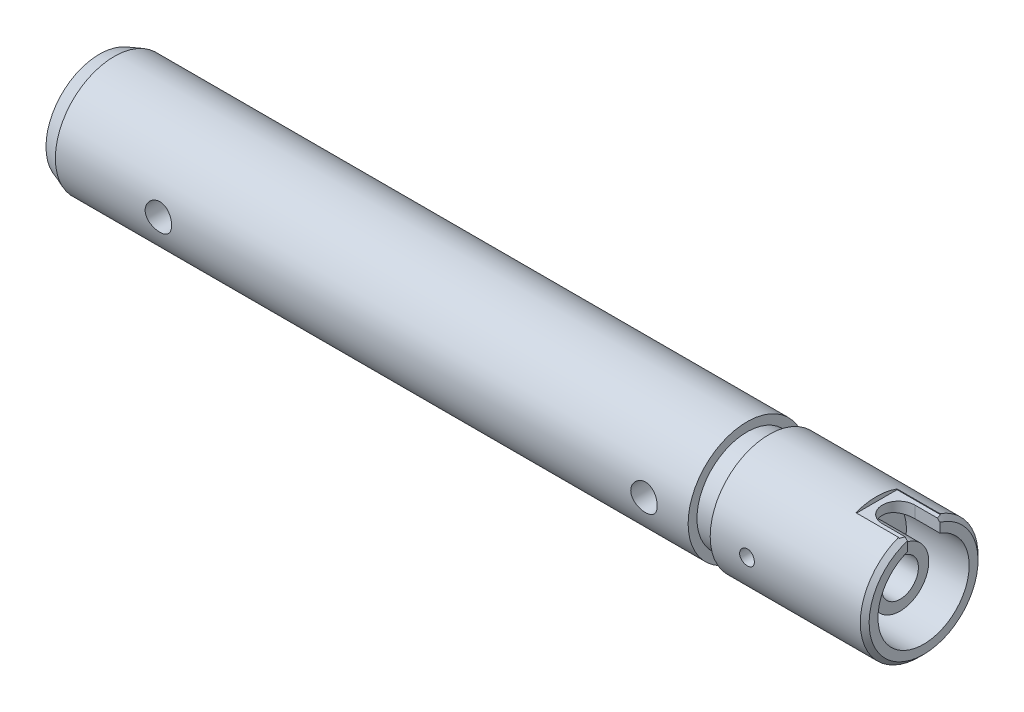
from build123d import *

# Parameters (mm, degrees)
SKIZZE2_R                            = 0.9
SKIZZE2_R_2                          = 0.5
SCHNITT_LINEAR_AUSTRAGEN2_DEPTH      = 82.403296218
SKIZZE6_W                            = 3.2
SKIZZE6_H                            = 0.3
SCHNITT_LINEAR_AUSTRAGEN7_DEPTH      = 1.4
SCHNITT_LINEAR_AUSTRAGEN6_REACH      = 83.669
SCHNITT_LINEAR_AUSTRAGEN6_END_RADIUS = 3.1
FASE1_SIZE                           = 0.3


with BuildPart() as part:
    # Skizze1 → Rotation1 (revolve)
    with BuildSketch(Plane.XY.offset(8), mode=Mode.PRIVATE) as rotation1_sk:
        Polygon((36.909177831, 2.5), (24.41453, 2.5), (24.41453, 3.636029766), (25.41453, 4), (68.41453, 4), (68.41453, 3.4), (69.91453, 3.4), (69.91453, 4), (80.41453, 4), (80.41453, 3.1), (76.14453, 3.1), (76.14453, 1.95), (78.81453, 1.95), (78.81453, 1.25), (62.909177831, 1.25), (62.909177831, 2), (36.909177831, 2), align=None)
    revolve(rotation1_sk.sketch.rotate(Axis((0, 0, 8), (1, 0, 0)), 90), axis=Axis((0, 0, 8), (1, 0, 0)))

    # Skizze2 → Schnitt-Linear austragen2 (cut, through all)
    with BuildSketch(Plane.XY):
        with Locations(Location((32.41453, 0, 0), (0, 0, 180))):
            Circle(SKIZZE2_R)
        with Locations(Location((72.41453, 0, 0), (0, 0, 180))):
            Circle(SKIZZE2_R_2)
        with Locations(Location((65.41453, 0, 0), (0, 0, 180))):
            Circle(SKIZZE2_R)
    extrude(amount=SCHNITT_LINEAR_AUSTRAGEN2_DEPTH, mode=Mode.SUBTRACT)

    # Skizze6 → Schnitt-Linear austragen7 (cut, symmetric)
    with BuildSketch(Plane.XY.offset(8)):
        with Locations((78.81453, 3.85)):
            Rectangle(SKIZZE6_W, SKIZZE6_H)
    extrude(amount=SCHNITT_LINEAR_AUSTRAGEN7_DEPTH, both=True, mode=Mode.SUBTRACT)

    # Schnitt-Linear austragen6: up to this cylinder (the profile starts outside it)
    schnitt_linear_austragen6_end = Plane(origin=(79.120806, 0, 8), z_dir=(-1, 0, 0)) * Cylinder(SCHNITT_LINEAR_AUSTRAGEN6_END_RADIUS, 174.538, mode=Mode.PRIVATE)
    # Skizze5 → Schnitt-Linear austragen6 (cut, up to the surface)
    with BuildSketch(Plane(origin=(0, 3.7, 0), x_dir=(1, 0, 0), z_dir=(0, 1, 0)), mode=Mode.PRIVATE) as schnitt_linear_austragen6_sk1:
        with BuildLine():
            Line((80.41453, -6.9), (78.71453, -6.9))
            ThreePointArc((78.71453, -6.9), (77.61453, -8), (78.71453, -9.1))
            Line((78.71453, -9.1), (80.41453, -9.1))
            Line((80.41453, -9.1), (80.41453, -6.9))
        make_face()
    schnitt_linear_austragen6_tool1 = extrude(schnitt_linear_austragen6_sk1.sketch, amount=-SCHNITT_LINEAR_AUSTRAGEN6_REACH, mode=Mode.PRIVATE) - schnitt_linear_austragen6_end
    add(schnitt_linear_austragen6_tool1.solids().sort_by_distance((79.120806, 3.7, 8))[0], mode=Mode.SUBTRACT)

    # Fase1
    fase1_edges = [part.edges().sort_by_distance(p)[0] for p in [
        (80.41453, -3.286335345, 5.71964915),
    ]]
    chamfer(fase1_edges, length=FASE1_SIZE)


solid = part.part
